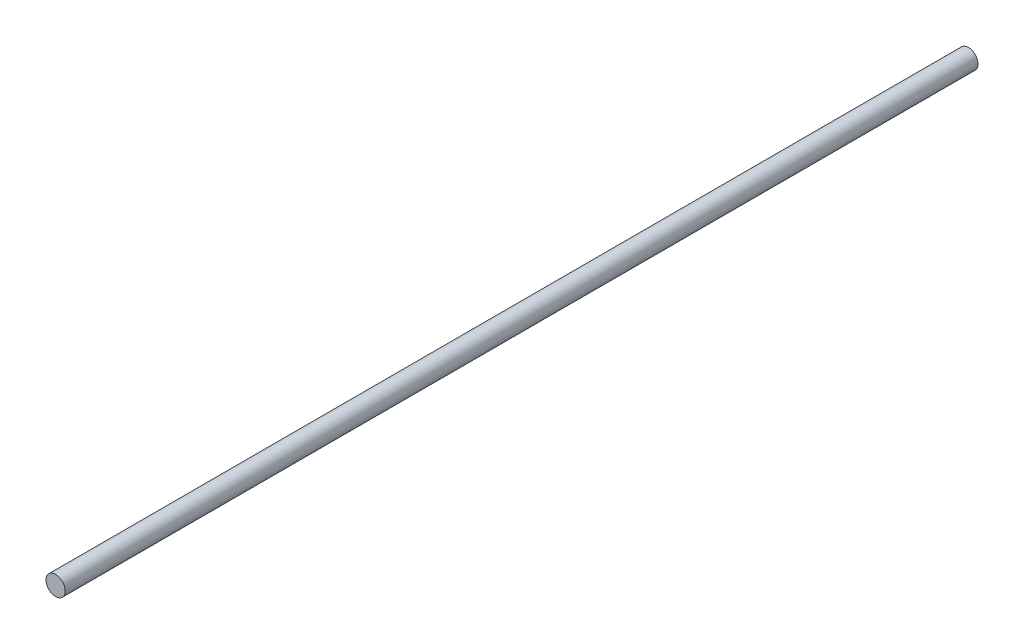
ISO-10303-21;
HEADER;
FILE_DESCRIPTION(('STEP AP214'),'2;1');
FILE_NAME('part.step','',(''),(''),'','','');
FILE_SCHEMA(('AUTOMOTIVE_DESIGN { 1 0 10303 214 1 1 1 1 }'));
ENDSEC;
DATA;
#1=APPLICATION_CONTEXT('core data for automotive mechanical design processes');
#2=APPLICATION_PROTOCOL_DEFINITION('international standard','automotive_design',2000,#1);
#3=PRODUCT_CONTEXT('',#1,'mechanical');
#4=PRODUCT('Part','Part','',(#3));
#5=PRODUCT_RELATED_PRODUCT_CATEGORY('part','',(#4));
#6=PRODUCT_DEFINITION_FORMATION('','',#4);
#7=PRODUCT_DEFINITION_CONTEXT('part definition',#1,'design');
#8=PRODUCT_DEFINITION('design','',#6,#7);
#9=PRODUCT_DEFINITION_SHAPE('','',#8);
#10=(LENGTH_UNIT() NAMED_UNIT(*) SI_UNIT(.MILLI.,.METRE.));
#11=(NAMED_UNIT(*) PLANE_ANGLE_UNIT() SI_UNIT($,.RADIAN.));
#12=(NAMED_UNIT(*) SI_UNIT($,.STERADIAN.) SOLID_ANGLE_UNIT());
#13=UNCERTAINTY_MEASURE_WITH_UNIT(LENGTH_MEASURE(1.E-05),#10,'distance_accuracy_value','');
#14=(GEOMETRIC_REPRESENTATION_CONTEXT(3) GLOBAL_UNCERTAINTY_ASSIGNED_CONTEXT((#13)) GLOBAL_UNIT_ASSIGNED_CONTEXT((#10,
#11,#12)) REPRESENTATION_CONTEXT('',''));
#15=CARTESIAN_POINT('',(0.,0.,0.));
#16=DIRECTION('',(0.,0.,1.));
#17=DIRECTION('',(1.,0.,0.));
#18=AXIS2_PLACEMENT_3D('',#15,#16,#17);
#19=CARTESIAN_POINT('',(0.,0.,-2850.));
#20=DIRECTION('',(0.,0.,1.));
#21=DIRECTION('',(1.,0.,0.));
#22=AXIS2_PLACEMENT_3D('',#19,#20,#21);
#23=CYLINDRICAL_SURFACE('',#22,30.);
#24=CARTESIAN_POINT('',(0.,0.,-2850.));
#25=DIRECTION('',(0.,0.,1.));
#26=DIRECTION('',(1.,0.,0.));
#27=AXIS2_PLACEMENT_3D('',#24,#25,#26);
#28=CIRCLE('',#27,30.);
#29=CARTESIAN_POINT('',(30.,0.,-2850.));
#30=VERTEX_POINT('',#29);
#31=EDGE_CURVE('E10',#30,#30,#28,.T.);
#32=ORIENTED_EDGE('',*,*,#31,.T.);
#33=EDGE_LOOP('',(#32));
#34=FACE_BOUND('',#33,.T.);
#35=CARTESIAN_POINT('',(0.,0.,0.));
#36=DIRECTION('',(0.,0.,1.));
#37=DIRECTION('',(1.,0.,0.));
#38=AXIS2_PLACEMENT_3D('',#35,#36,#37);
#39=CIRCLE('',#38,30.);
#40=CARTESIAN_POINT('',(30.,0.,0.));
#41=VERTEX_POINT('',#40);
#42=EDGE_CURVE('E40',#41,#41,#39,.T.);
#43=ORIENTED_EDGE('',*,*,#42,.F.);
#44=EDGE_LOOP('',(#43));
#45=FACE_BOUND('',#44,.T.);
#46=ADVANCED_FACE('F37',(#34,#45),#23,.T.);
#47=CARTESIAN_POINT('',(0.,0.,-2850.));
#48=DIRECTION('',(0.,0.,1.));
#49=DIRECTION('',(1.,0.,0.));
#50=AXIS2_PLACEMENT_3D('',#47,#48,#49);
#51=PLANE('',#50);
#52=ORIENTED_EDGE('',*,*,#31,.F.);
#53=EDGE_LOOP('',(#52));
#54=FACE_BOUND('',#53,.T.);
#55=ADVANCED_FACE('F54',(#54),#51,.F.);
#56=CARTESIAN_POINT('',(0.,0.,0.));
#57=DIRECTION('',(0.,0.,1.));
#58=DIRECTION('',(1.,0.,0.));
#59=AXIS2_PLACEMENT_3D('',#56,#57,#58);
#60=PLANE('',#59);
#61=ORIENTED_EDGE('',*,*,#42,.T.);
#62=EDGE_LOOP('',(#61));
#63=FACE_BOUND('',#62,.T.);
#64=ADVANCED_FACE('F51',(#63),#60,.T.);
#65=CLOSED_SHELL('',(#46,#55,#64));
#66=MANIFOLD_SOLID_BREP('B2',#65);
#67=ADVANCED_BREP_SHAPE_REPRESENTATION('',(#18,#66),#14);
#68=SHAPE_DEFINITION_REPRESENTATION(#9,#67);
ENDSEC;
END-ISO-10303-21;
